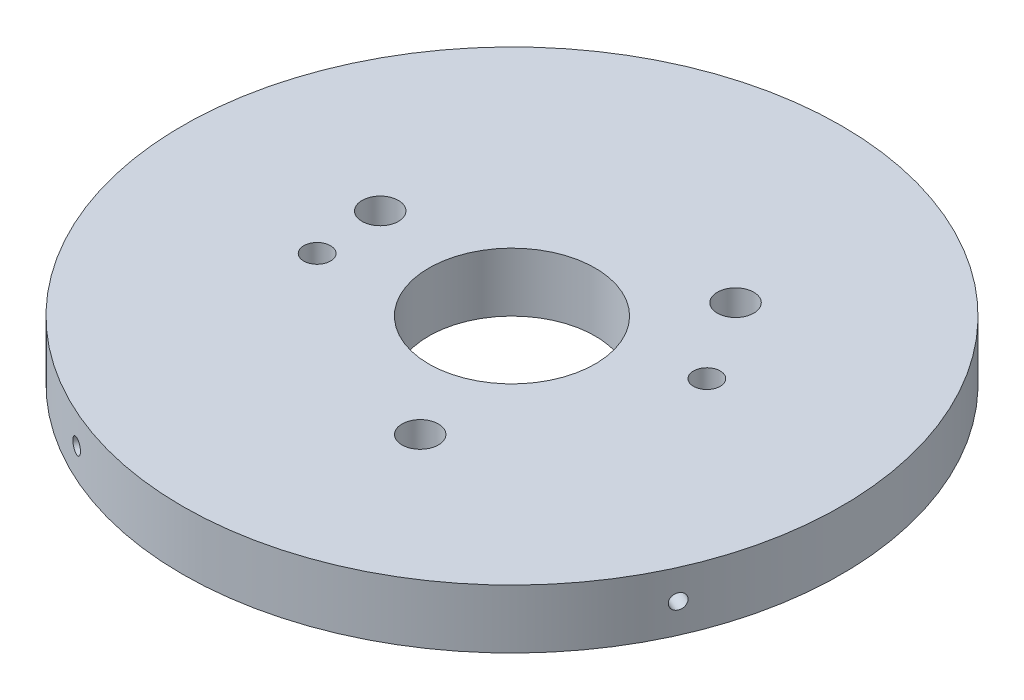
ISO-10303-21;
HEADER;
FILE_DESCRIPTION(('STEP AP214'),'2;1');
FILE_NAME('part.step','',(''),(''),'','','');
FILE_SCHEMA(('AUTOMOTIVE_DESIGN { 1 0 10303 214 1 1 1 1 }'));
ENDSEC;
DATA;
#1=APPLICATION_CONTEXT('core data for automotive mechanical design processes');
#2=APPLICATION_PROTOCOL_DEFINITION('international standard','automotive_design',2000,#1);
#3=PRODUCT_CONTEXT('',#1,'mechanical');
#4=PRODUCT('Part','Part','',(#3));
#5=PRODUCT_RELATED_PRODUCT_CATEGORY('part','',(#4));
#6=PRODUCT_DEFINITION_FORMATION('','',#4);
#7=PRODUCT_DEFINITION_CONTEXT('part definition',#1,'design');
#8=PRODUCT_DEFINITION('design','',#6,#7);
#9=PRODUCT_DEFINITION_SHAPE('','',#8);
#10=(LENGTH_UNIT() NAMED_UNIT(*) SI_UNIT(.MILLI.,.METRE.));
#11=(NAMED_UNIT(*) PLANE_ANGLE_UNIT() SI_UNIT($,.RADIAN.));
#12=(NAMED_UNIT(*) SI_UNIT($,.STERADIAN.) SOLID_ANGLE_UNIT());
#13=UNCERTAINTY_MEASURE_WITH_UNIT(LENGTH_MEASURE(1.E-05),#10,'distance_accuracy_value','');
#14=(GEOMETRIC_REPRESENTATION_CONTEXT(3) GLOBAL_UNCERTAINTY_ASSIGNED_CONTEXT((#13)) GLOBAL_UNIT_ASSIGNED_CONTEXT((#10,
#11,#12)) REPRESENTATION_CONTEXT('',''));
#15=CARTESIAN_POINT('',(0.,0.,0.));
#16=DIRECTION('',(0.,0.,1.));
#17=DIRECTION('',(1.,0.,0.));
#18=AXIS2_PLACEMENT_3D('',#15,#16,#17);
#19=CARTESIAN_POINT('',(0.,0.,0.));
#20=DIRECTION('',(0.,1.,0.));
#21=DIRECTION('',(0.,0.,1.));
#22=AXIS2_PLACEMENT_3D('',#19,#20,#21);
#23=PLANE('',#22);
#24=CARTESIAN_POINT('',(22.90521231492,0.,-6.52195682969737));
#25=DIRECTION('',(0.,-1.,0.));
#26=DIRECTION('',(0.,0.,-1.));
#27=AXIS2_PLACEMENT_3D('',#24,#25,#26);
#28=CIRCLE('',#27,2.01929999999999);
#29=CARTESIAN_POINT('',(22.90521231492,0.,-8.54125682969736));
#30=VERTEX_POINT('',#29);
#31=EDGE_CURVE('E77',#30,#30,#28,.T.);
#32=ORIENTED_EDGE('',*,*,#31,.F.);
#33=EDGE_LOOP('',(#32));
#34=FACE_BOUND('',#33,.T.);
#35=CARTESIAN_POINT('',(15.1382985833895,0.,-18.6234238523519));
#36=DIRECTION('',(0.,-1.,0.));
#37=DIRECTION('',(0.,0.,-1.));
#38=AXIS2_PLACEMENT_3D('',#35,#36,#37);
#39=CIRCLE('',#38,6.12);
#40=CARTESIAN_POINT('',(15.1382985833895,0.,-24.7434238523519));
#41=VERTEX_POINT('',#40);
#42=EDGE_CURVE('E86',#41,#41,#39,.T.);
#43=ORIENTED_EDGE('',*,*,#42,.F.);
#44=EDGE_LOOP('',(#43));
#45=FACE_BOUND('',#44,.T.);
#46=CARTESIAN_POINT('',(8.55920886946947,0.,22.4218630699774));
#47=DIRECTION('',(0.,-1.,0.));
#48=DIRECTION('',(0.,0.,-1.));
#49=AXIS2_PLACEMENT_3D('',#46,#47,#48);
#50=CIRCLE('',#49,6.12);
#51=CARTESIAN_POINT('',(8.55920886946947,0.,16.3018630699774));
#52=VERTEX_POINT('',#51);
#53=EDGE_CURVE('E98',#52,#52,#50,.T.);
#54=ORIENTED_EDGE('',*,*,#53,.F.);
#55=EDGE_LOOP('',(#54));
#56=FACE_BOUND('',#55,.T.);
#57=CARTESIAN_POINT('',(-23.6975074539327,0.,-3.79843921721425));
#58=DIRECTION('',(0.,-1.,0.));
#59=DIRECTION('',(0.,0.,-1.));
#60=AXIS2_PLACEMENT_3D('',#57,#58,#59);
#61=CIRCLE('',#60,6.12);
#62=CARTESIAN_POINT('',(-23.6975074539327,0.,-9.91843921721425));
#63=VERTEX_POINT('',#62);
#64=EDGE_CURVE('E110',#63,#63,#61,.T.);
#65=ORIENTED_EDGE('',*,*,#64,.F.);
#66=EDGE_LOOP('',(#65));
#67=FACE_BOUND('',#66,.T.);
#68=CARTESIAN_POINT('',(0.,0.,0.));
#69=DIRECTION('',(0.,1.,0.));
#70=DIRECTION('',(0.,0.,1.));
#71=AXIS2_PLACEMENT_3D('',#68,#69,#70);
#72=CIRCLE('',#71,49.7713);
#73=CARTESIAN_POINT('',(0.,0.,49.7713));
#74=VERTEX_POINT('',#73);
#75=EDGE_CURVE('E126',#74,#74,#72,.T.);
#76=ORIENTED_EDGE('',*,*,#75,.F.);
#77=EDGE_LOOP('',(#76));
#78=FACE_BOUND('',#77,.T.);
#79=CARTESIAN_POINT('',(0.,0.,0.));
#80=DIRECTION('',(0.,1.,0.));
#81=DIRECTION('',(0.,0.,1.));
#82=AXIS2_PLACEMENT_3D('',#79,#80,#81);
#83=CIRCLE('',#82,12.5603);
#84=CARTESIAN_POINT('',(0.,0.,12.5603));
#85=VERTEX_POINT('',#84);
#86=EDGE_CURVE('E122',#85,#85,#83,.T.);
#87=ORIENTED_EDGE('',*,*,#86,.T.);
#88=EDGE_LOOP('',(#87));
#89=FACE_BOUND('',#88,.T.);
#90=CARTESIAN_POINT('',(-22.90521231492,0.,6.52195682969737));
#91=DIRECTION('',(0.,-1.,0.));
#92=DIRECTION('',(0.,0.,-1.));
#93=AXIS2_PLACEMENT_3D('',#90,#91,#92);
#94=CIRCLE('',#93,2.01929999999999);
#95=CARTESIAN_POINT('',(-22.90521231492,0.,4.50265682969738));
#96=VERTEX_POINT('',#95);
#97=EDGE_CURVE('E217',#96,#96,#94,.T.);
#98=ORIENTED_EDGE('',*,*,#97,.F.);
#99=EDGE_LOOP('',(#98));
#100=FACE_BOUND('',#99,.T.);
#101=ADVANCED_FACE('F35',(#34,#45,#56,#67,#78,#89,#100),#23,.F.);
#102=CARTESIAN_POINT('',(0.,8.89,0.));
#103=DIRECTION('',(0.,1.,0.));
#104=DIRECTION('',(0.,0.,1.));
#105=AXIS2_PLACEMENT_3D('',#102,#103,#104);
#106=PLANE('',#105);
#107=CARTESIAN_POINT('',(-22.90521231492,8.89,6.52195682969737));
#108=DIRECTION('',(0.,-1.,0.));
#109=DIRECTION('',(0.,0.,-1.));
#110=AXIS2_PLACEMENT_3D('',#107,#108,#109);
#111=CIRCLE('',#110,2.0193);
#112=CARTESIAN_POINT('',(-22.90521231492,8.89,4.50265682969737));
#113=VERTEX_POINT('',#112);
#114=EDGE_CURVE('E219',#113,#113,#111,.T.);
#115=ORIENTED_EDGE('',*,*,#114,.T.);
#116=EDGE_LOOP('',(#115));
#117=FACE_BOUND('',#116,.T.);
#118=CARTESIAN_POINT('',(22.90521231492,8.89,-6.52195682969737));
#119=DIRECTION('',(0.,-1.,0.));
#120=DIRECTION('',(0.,0.,-1.));
#121=AXIS2_PLACEMENT_3D('',#118,#119,#120);
#122=CIRCLE('',#121,2.0193);
#123=CARTESIAN_POINT('',(22.90521231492,8.89,-8.54125682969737));
#124=VERTEX_POINT('',#123);
#125=EDGE_CURVE('E71',#124,#124,#122,.T.);
#126=ORIENTED_EDGE('',*,*,#125,.T.);
#127=EDGE_LOOP('',(#126));
#128=FACE_BOUND('',#127,.T.);
#129=CARTESIAN_POINT('',(15.1382985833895,8.89,-18.6234238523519));
#130=DIRECTION('',(0.,-1.,0.));
#131=DIRECTION('',(0.,0.,-1.));
#132=AXIS2_PLACEMENT_3D('',#129,#130,#131);
#133=CIRCLE('',#132,2.75);
#134=CARTESIAN_POINT('',(15.1382985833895,8.89,-21.3734238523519));
#135=VERTEX_POINT('',#134);
#136=EDGE_CURVE('E95',#135,#135,#133,.T.);
#137=ORIENTED_EDGE('',*,*,#136,.T.);
#138=EDGE_LOOP('',(#137));
#139=FACE_BOUND('',#138,.T.);
#140=CARTESIAN_POINT('',(8.55920886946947,8.89,22.4218630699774));
#141=DIRECTION('',(0.,-1.,0.));
#142=DIRECTION('',(0.,0.,-1.));
#143=AXIS2_PLACEMENT_3D('',#140,#141,#142);
#144=CIRCLE('',#143,2.75);
#145=CARTESIAN_POINT('',(8.55920886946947,8.89,19.6718630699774));
#146=VERTEX_POINT('',#145);
#147=EDGE_CURVE('E107',#146,#146,#144,.T.);
#148=ORIENTED_EDGE('',*,*,#147,.T.);
#149=EDGE_LOOP('',(#148));
#150=FACE_BOUND('',#149,.T.);
#151=CARTESIAN_POINT('',(-23.6975074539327,8.89,-3.79843921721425));
#152=DIRECTION('',(0.,-1.,0.));
#153=DIRECTION('',(0.,0.,-1.));
#154=AXIS2_PLACEMENT_3D('',#151,#152,#153);
#155=CIRCLE('',#154,2.75);
#156=CARTESIAN_POINT('',(-23.6975074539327,8.89,-6.54843921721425));
#157=VERTEX_POINT('',#156);
#158=EDGE_CURVE('E119',#157,#157,#155,.T.);
#159=ORIENTED_EDGE('',*,*,#158,.T.);
#160=EDGE_LOOP('',(#159));
#161=FACE_BOUND('',#160,.T.);
#162=CARTESIAN_POINT('',(0.,8.89,0.));
#163=DIRECTION('',(0.,1.,0.));
#164=DIRECTION('',(0.,0.,1.));
#165=AXIS2_PLACEMENT_3D('',#162,#163,#164);
#166=CIRCLE('',#165,49.7713);
#167=CARTESIAN_POINT('',(0.,8.89,49.7713));
#168=VERTEX_POINT('',#167);
#169=EDGE_CURVE('E129',#168,#168,#166,.T.);
#170=ORIENTED_EDGE('',*,*,#169,.T.);
#171=EDGE_LOOP('',(#170));
#172=FACE_BOUND('',#171,.T.);
#173=CARTESIAN_POINT('',(0.,8.89,0.));
#174=DIRECTION('',(0.,1.,0.));
#175=DIRECTION('',(0.,0.,1.));
#176=AXIS2_PLACEMENT_3D('',#173,#174,#175);
#177=CIRCLE('',#176,12.5603);
#178=CARTESIAN_POINT('',(0.,8.89,12.5603));
#179=VERTEX_POINT('',#178);
#180=EDGE_CURVE('E123',#179,#179,#177,.T.);
#181=ORIENTED_EDGE('',*,*,#180,.F.);
#182=EDGE_LOOP('',(#181));
#183=FACE_BOUND('',#182,.T.);
#184=ADVANCED_FACE('F195',(#117,#128,#139,#150,#161,#172,#183),#106,.T.);
#185=CARTESIAN_POINT('',(0.,8.89,0.));
#186=DIRECTION('',(0.,-1.,0.));
#187=DIRECTION('',(0.,0.,-1.));
#188=AXIS2_PLACEMENT_3D('',#185,#186,#187);
#189=CYLINDRICAL_SURFACE('',#188,49.7713);
#190=CARTESIAN_POINT('',(45.8793955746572,4.445,19.2941277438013));
#191=CARTESIAN_POINT('',(45.8793945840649,4.38151933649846,19.2941303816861));
#192=CARTESIAN_POINT('',(45.8773157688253,4.31799285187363,19.2990756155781));
#193=CARTESIAN_POINT('',(45.8690427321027,4.19269003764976,19.3187300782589));
#194=CARTESIAN_POINT('',(45.862843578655,4.13091589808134,19.3334510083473));
#195=CARTESIAN_POINT('',(45.8464791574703,4.01095119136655,19.3722247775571));
#196=CARTESIAN_POINT('',(45.8363158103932,3.95275890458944,19.3962730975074));
#197=CARTESIAN_POINT('',(45.812272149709,3.84159852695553,19.4529938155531));
#198=CARTESIAN_POINT('',(45.7983927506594,3.78862915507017,19.4856640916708));
#199=CARTESIAN_POINT('',(45.7672534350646,3.68938469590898,19.5586908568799));
#200=CARTESIAN_POINT('',(45.7499926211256,3.64311139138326,19.5990493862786));
#201=CARTESIAN_POINT('',(45.7125254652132,3.55858743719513,19.6862786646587));
#202=CARTESIAN_POINT('',(45.6923190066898,3.52033710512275,19.7331496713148));
#203=CARTESIAN_POINT('',(45.6494782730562,3.45294378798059,19.8320532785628));
#204=CARTESIAN_POINT('',(45.6268437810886,3.42380161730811,19.8840863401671));
#205=CARTESIAN_POINT('',(45.5797451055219,3.375457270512,19.9918131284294));
#206=CARTESIAN_POINT('',(45.5552809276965,3.35625506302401,20.0475068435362));
#207=CARTESIAN_POINT('',(45.5051894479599,3.32833885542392,20.1609493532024));
#208=CARTESIAN_POINT('',(45.4795623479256,3.31962304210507,20.2186977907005));
#209=CARTESIAN_POINT('',(45.4278535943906,3.31292145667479,20.3346120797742));
#210=CARTESIAN_POINT('',(45.4017719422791,3.31493565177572,20.3927779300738));
#211=CARTESIAN_POINT('',(45.3499030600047,3.32963534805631,20.5078663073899));
#212=CARTESIAN_POINT('',(45.3241157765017,3.34231888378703,20.5647890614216));
#213=CARTESIAN_POINT('',(45.2735845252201,3.37799418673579,20.6757967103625));
#214=CARTESIAN_POINT('',(45.2488405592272,3.40098597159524,20.7298816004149));
#215=CARTESIAN_POINT('',(45.2011335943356,3.45662736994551,20.8337009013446));
#216=CARTESIAN_POINT('',(45.1781707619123,3.48927788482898,20.8834349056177));
#217=CARTESIAN_POINT('',(45.1347294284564,3.56330922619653,20.9771584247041));
#218=CARTESIAN_POINT('',(45.1142509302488,3.60469006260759,21.0211479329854));
#219=CARTESIAN_POINT('',(45.0764103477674,3.69501852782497,21.1021690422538));
#220=CARTESIAN_POINT('',(45.059048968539,3.74396786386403,21.1391990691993));
#221=CARTESIAN_POINT('',(45.0279964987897,3.84803779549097,21.2052628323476));
#222=CARTESIAN_POINT('',(45.0143054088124,3.90315839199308,21.2342965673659));
#223=CARTESIAN_POINT('',(44.9910312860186,4.01800710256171,21.2835653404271));
#224=CARTESIAN_POINT('',(44.9814482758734,4.07773524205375,21.3038003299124));
#225=CARTESIAN_POINT('',(44.966699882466,4.20010312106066,21.3349128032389));
#226=CARTESIAN_POINT('',(44.9615344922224,4.26274285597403,21.3457903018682));
#227=CARTESIAN_POINT('',(44.955789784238,4.38914079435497,21.357886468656));
#228=CARTESIAN_POINT('',(44.9552094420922,4.45289874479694,21.3591072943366));
#229=CARTESIAN_POINT('',(44.9586510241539,4.57973640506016,21.3518621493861));
#230=CARTESIAN_POINT('',(44.9626729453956,4.64281611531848,21.3433961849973));
#231=CARTESIAN_POINT('',(44.9751876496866,4.76650001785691,21.3170122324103));
#232=CARTESIAN_POINT('',(44.9836799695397,4.82710446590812,21.299095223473));
#233=CARTESIAN_POINT('',(45.0048606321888,4.94412532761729,21.2543038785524));
#234=CARTESIAN_POINT('',(45.0175489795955,5.00054173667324,21.2274295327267));
#235=CARTESIAN_POINT('',(45.0467176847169,5.10759604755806,21.165460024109));
#236=CARTESIAN_POINT('',(45.0631987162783,5.15823292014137,21.1303634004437));
#237=CARTESIAN_POINT('',(45.0994295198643,5.25228041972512,21.052923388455));
#238=CARTESIAN_POINT('',(45.1191792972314,5.29569103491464,21.0105799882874));
#239=CARTESIAN_POINT('',(45.1613350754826,5.37406168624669,20.9198139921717));
#240=CARTESIAN_POINT('',(45.183741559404,5.40902018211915,20.8713902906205));
#241=CARTESIAN_POINT('',(45.2305203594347,5.46948369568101,20.7698207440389));
#242=CARTESIAN_POINT('',(45.2548926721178,5.49498872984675,20.7166749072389));
#243=CARTESIAN_POINT('',(45.3048675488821,5.53581863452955,20.6071565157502));
#244=CARTESIAN_POINT('',(45.3304699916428,5.55114450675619,20.5507842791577));
#245=CARTESIAN_POINT('',(45.3821541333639,5.57118433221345,20.436397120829));
#246=CARTESIAN_POINT('',(45.4082358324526,5.5758982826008,20.3783821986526));
#247=CARTESIAN_POINT('',(45.4601234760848,5.57458031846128,20.2623669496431));
#248=CARTESIAN_POINT('',(45.4859294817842,5.56855083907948,20.204366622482));
#249=CARTESIAN_POINT('',(45.5365498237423,5.54592216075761,20.0900185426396));
#250=CARTESIAN_POINT('',(45.5613641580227,5.52932294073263,20.0336707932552));
#251=CARTESIAN_POINT('',(45.60932562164,5.48602613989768,19.9242388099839));
#252=CARTESIAN_POINT('',(45.6324727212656,5.45932837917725,19.8711546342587));
#253=CARTESIAN_POINT('',(45.6764846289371,5.39659367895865,19.7697777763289));
#254=CARTESIAN_POINT('',(45.6973495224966,5.36055708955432,19.7214849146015));
#255=CARTESIAN_POINT('',(45.7362612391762,5.28016238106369,19.631075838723));
#256=CARTESIAN_POINT('',(45.7543077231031,5.23580326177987,19.588960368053));
#257=CARTESIAN_POINT('',(45.7871282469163,5.14001039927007,19.5121229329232));
#258=CARTESIAN_POINT('',(45.8019014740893,5.08857490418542,19.4774028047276));
#259=CARTESIAN_POINT('',(45.827811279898,4.98007401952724,19.4163621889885));
#260=CARTESIAN_POINT('',(45.8389457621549,4.92300540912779,19.390046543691));
#261=CARTESIAN_POINT('',(45.8572852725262,4.80492493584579,19.3466341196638));
#262=CARTESIAN_POINT('',(45.8644949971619,4.74391788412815,19.3295263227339));
#263=CARTESIAN_POINT('',(45.8728972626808,4.64293665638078,19.3095744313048));
#264=CARTESIAN_POINT('',(45.8753314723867,4.60361823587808,19.3037893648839));
#265=CARTESIAN_POINT('',(45.8785809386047,4.52453920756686,19.296065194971));
#266=CARTESIAN_POINT('',(45.8793961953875,4.4847785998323,19.2941260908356));
#267=CARTESIAN_POINT('',(45.8793955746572,4.445,19.2941277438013));
#268=B_SPLINE_CURVE_WITH_KNOTS('',3,(#190,#191,#192,#193,#194,#195,#196,#197,#198,#199,#200,
#201,#202,#203,#204,#205,#206,#207,#208,#209,#210,#211,#212,#213,#214,#215,#216,#217,#218,#219,
#220,#221,#222,#223,#224,#225,#226,#227,#228,#229,#230,#231,#232,#233,#234,#235,#236,#237,#238,
#239,#240,#241,#242,#243,#244,#245,#246,#247,#248,#249,#250,#251,#252,#253,#254,#255,#256,#257,
#258,#259,#260,#261,#262,#263,#264,#265,#266,#267),.UNSPECIFIED.,.T.,.F.,(4,2,2,2,2,2,2,2,2,2,2,
2,2,2,2,2,2,2,2,2,2,2,2,2,2,2,2,2,2,2,2,2,2,2,2,2,2,2,4),(0.,0.190296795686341,
0.380821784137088,0.571254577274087,0.761640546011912,0.952077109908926,1.14252121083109,
1.33298233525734,1.52344285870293,1.7138704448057,1.90429744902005,2.09468938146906,
2.28508163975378,2.47549167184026,2.66590192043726,2.85635518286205,3.04680847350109,
3.23726281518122,3.42771685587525,3.61812834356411,3.80853970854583,3.9989313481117,
4.18932319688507,4.37974889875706,4.57017491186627,4.76063560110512,4.95109595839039,
5.14153757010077,5.33197923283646,5.52237773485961,5.71277661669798,5.90317889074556,
6.09357402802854,6.28399206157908,6.47445732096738,6.66503211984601,6.85537836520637,
6.97462320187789,7.09386801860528),.UNSPECIFIED.);
#269=CARTESIAN_POINT('',(45.8793955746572,4.445,19.2941277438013));
#270=VERTEX_POINT('',#269);
#271=EDGE_CURVE('E11',#270,#270,#268,.T.);
#272=ORIENTED_EDGE('',*,*,#271,.T.);
#273=EDGE_LOOP('',(#272));
#274=FACE_BOUND('',#273,.T.);
#275=CARTESIAN_POINT('',(19.2941277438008,4.445,-45.8793955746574));
#276=CARTESIAN_POINT('',(19.2941303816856,4.38151933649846,-45.8793945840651));
#277=CARTESIAN_POINT('',(19.2990756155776,4.31799285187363,-45.8773157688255));
#278=CARTESIAN_POINT('',(19.3187300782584,4.19269003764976,-45.8690427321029));
#279=CARTESIAN_POINT('',(19.3334510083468,4.13091589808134,-45.8628435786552));
#280=CARTESIAN_POINT('',(19.3722247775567,4.01095119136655,-45.8464791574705));
#281=CARTESIAN_POINT('',(19.3962730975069,3.95275890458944,-45.8363158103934));
#282=CARTESIAN_POINT('',(19.4529938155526,3.84159852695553,-45.8122721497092));
#283=CARTESIAN_POINT('',(19.4856640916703,3.78862915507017,-45.7983927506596));
#284=CARTESIAN_POINT('',(19.5586908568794,3.68938469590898,-45.7672534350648));
#285=CARTESIAN_POINT('',(19.5990493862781,3.64311139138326,-45.7499926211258));
#286=CARTESIAN_POINT('',(19.6862786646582,3.55858743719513,-45.7125254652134));
#287=CARTESIAN_POINT('',(19.7331496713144,3.52033710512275,-45.69231900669));
#288=CARTESIAN_POINT('',(19.8320532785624,3.45294378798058,-45.6494782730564));
#289=CARTESIAN_POINT('',(19.8840863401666,3.42380161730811,-45.6268437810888));
#290=CARTESIAN_POINT('',(19.9918131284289,3.375457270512,-45.5797451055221));
#291=CARTESIAN_POINT('',(20.0475068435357,3.35625506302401,-45.5552809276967));
#292=CARTESIAN_POINT('',(20.1609493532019,3.32833885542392,-45.5051894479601));
#293=CARTESIAN_POINT('',(20.2186977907,3.31962304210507,-45.4795623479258));
#294=CARTESIAN_POINT('',(20.3346120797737,3.31292145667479,-45.4278535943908));
#295=CARTESIAN_POINT('',(20.3927779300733,3.31493565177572,-45.4017719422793));
#296=CARTESIAN_POINT('',(20.5078663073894,3.32963534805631,-45.349903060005));
#297=CARTESIAN_POINT('',(20.5647890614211,3.34231888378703,-45.3241157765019));
#298=CARTESIAN_POINT('',(20.6757967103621,3.37799418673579,-45.2735845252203));
#299=CARTESIAN_POINT('',(20.7298816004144,3.40098597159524,-45.2488405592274));
#300=CARTESIAN_POINT('',(20.8337009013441,3.45662736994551,-45.2011335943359));
#301=CARTESIAN_POINT('',(20.8834349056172,3.48927788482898,-45.1781707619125));
#302=CARTESIAN_POINT('',(20.9771584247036,3.56330922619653,-45.1347294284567));
#303=CARTESIAN_POINT('',(21.0211479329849,3.60469006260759,-45.114250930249));
#304=CARTESIAN_POINT('',(21.1021690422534,3.69501852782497,-45.0764103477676));
#305=CARTESIAN_POINT('',(21.1391990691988,3.74396786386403,-45.0590489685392));
#306=CARTESIAN_POINT('',(21.2052628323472,3.84803779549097,-45.0279964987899));
#307=CARTESIAN_POINT('',(21.2342965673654,3.90315839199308,-45.0143054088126));
#308=CARTESIAN_POINT('',(21.2835653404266,4.01800710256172,-44.9910312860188));
#309=CARTESIAN_POINT('',(21.3038003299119,4.07773524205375,-44.9814482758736));
#310=CARTESIAN_POINT('',(21.3349128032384,4.20010312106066,-44.9666998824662));
#311=CARTESIAN_POINT('',(21.3457903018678,4.26274285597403,-44.9615344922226));
#312=CARTESIAN_POINT('',(21.3578864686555,4.38914079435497,-44.9557897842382));
#313=CARTESIAN_POINT('',(21.3591072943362,4.45289874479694,-44.9552094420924));
#314=CARTESIAN_POINT('',(21.3518621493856,4.57973640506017,-44.9586510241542));
#315=CARTESIAN_POINT('',(21.3433961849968,4.64281611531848,-44.9626729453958));
#316=CARTESIAN_POINT('',(21.3170122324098,4.76650001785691,-44.9751876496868));
#317=CARTESIAN_POINT('',(21.2990952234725,4.82710446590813,-44.9836799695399));
#318=CARTESIAN_POINT('',(21.254303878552,4.94412532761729,-45.0048606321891));
#319=CARTESIAN_POINT('',(21.2274295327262,5.00054173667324,-45.0175489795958));
#320=CARTESIAN_POINT('',(21.1654600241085,5.10759604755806,-45.0467176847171));
#321=CARTESIAN_POINT('',(21.1303634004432,5.15823292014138,-45.0631987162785));
#322=CARTESIAN_POINT('',(21.0529233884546,5.25228041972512,-45.0994295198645));
#323=CARTESIAN_POINT('',(21.0105799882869,5.29569103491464,-45.1191792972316));
#324=CARTESIAN_POINT('',(20.9198139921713,5.37406168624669,-45.1613350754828));
#325=CARTESIAN_POINT('',(20.87139029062,5.40902018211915,-45.1837415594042));
#326=CARTESIAN_POINT('',(20.7698207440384,5.46948369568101,-45.2305203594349));
#327=CARTESIAN_POINT('',(20.7166749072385,5.49498872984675,-45.254892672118));
#328=CARTESIAN_POINT('',(20.6071565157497,5.53581863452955,-45.3048675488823));
#329=CARTESIAN_POINT('',(20.5507842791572,5.55114450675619,-45.330469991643));
#330=CARTESIAN_POINT('',(20.4363971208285,5.57118433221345,-45.3821541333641));
#331=CARTESIAN_POINT('',(20.3783821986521,5.5758982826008,-45.4082358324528));
#332=CARTESIAN_POINT('',(20.2623669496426,5.57458031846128,-45.460123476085));
#333=CARTESIAN_POINT('',(20.2043666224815,5.56855083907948,-45.4859294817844));
#334=CARTESIAN_POINT('',(20.0900185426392,5.54592216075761,-45.5365498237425));
#335=CARTESIAN_POINT('',(20.0336707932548,5.52932294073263,-45.5613641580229));
#336=CARTESIAN_POINT('',(19.9242388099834,5.48602613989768,-45.6093256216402));
#337=CARTESIAN_POINT('',(19.8711546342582,5.45932837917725,-45.6324727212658));
#338=CARTESIAN_POINT('',(19.7697777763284,5.39659367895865,-45.6764846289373));
#339=CARTESIAN_POINT('',(19.721484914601,5.36055708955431,-45.6973495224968));
#340=CARTESIAN_POINT('',(19.6310758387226,5.28016238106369,-45.7362612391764));
#341=CARTESIAN_POINT('',(19.5889603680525,5.23580326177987,-45.7543077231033));
#342=CARTESIAN_POINT('',(19.5121229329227,5.14001039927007,-45.7871282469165));
#343=CARTESIAN_POINT('',(19.4774028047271,5.08857490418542,-45.8019014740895));
#344=CARTESIAN_POINT('',(19.416362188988,4.98007401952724,-45.8278112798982));
#345=CARTESIAN_POINT('',(19.3900465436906,4.92300540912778,-45.8389457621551));
#346=CARTESIAN_POINT('',(19.3466341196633,4.80492493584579,-45.8572852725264));
#347=CARTESIAN_POINT('',(19.3295263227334,4.74391788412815,-45.8644949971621));
#348=CARTESIAN_POINT('',(19.3095744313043,4.64293665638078,-45.872897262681));
#349=CARTESIAN_POINT('',(19.3037893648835,4.60361823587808,-45.8753314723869));
#350=CARTESIAN_POINT('',(19.2960651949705,4.52453920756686,-45.8785809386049));
#351=CARTESIAN_POINT('',(19.2941260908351,4.4847785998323,-45.8793961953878));
#352=CARTESIAN_POINT('',(19.2941277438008,4.445,-45.8793955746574));
#353=B_SPLINE_CURVE_WITH_KNOTS('',3,(#275,#276,#277,#278,#279,#280,#281,#282,#283,#284,#285,
#286,#287,#288,#289,#290,#291,#292,#293,#294,#295,#296,#297,#298,#299,#300,#301,#302,#303,#304,
#305,#306,#307,#308,#309,#310,#311,#312,#313,#314,#315,#316,#317,#318,#319,#320,#321,#322,#323,
#324,#325,#326,#327,#328,#329,#330,#331,#332,#333,#334,#335,#336,#337,#338,#339,#340,#341,#342,
#343,#344,#345,#346,#347,#348,#349,#350,#351,#352),.UNSPECIFIED.,.T.,.F.,(4,2,2,2,2,2,2,2,2,2,2,
2,2,2,2,2,2,2,2,2,2,2,2,2,2,2,2,2,2,2,2,2,2,2,2,2,2,2,4),(0.,0.190296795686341,0.38082178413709,
0.571254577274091,0.761640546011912,0.95207710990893,1.1425212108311,1.33298233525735,
1.52344285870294,1.7138704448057,1.90429744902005,2.09468938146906,2.28508163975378,
2.47549167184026,2.66590192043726,2.85635518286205,3.04680847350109,3.23726281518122,
3.42771685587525,3.61812834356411,3.80853970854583,3.9989313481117,4.18932319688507,
4.37974889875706,4.57017491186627,4.76063560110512,4.95109595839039,5.14153757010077,
5.33197923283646,5.5223777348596,5.71277661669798,5.90317889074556,6.09357402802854,
6.28399206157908,6.47445732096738,6.66503211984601,6.85537836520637,6.97462320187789,
7.09386801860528),.UNSPECIFIED.);
#354=CARTESIAN_POINT('',(19.2941277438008,4.445,-45.8793955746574));
#355=VERTEX_POINT('',#354);
#356=EDGE_CURVE('E47',#355,#355,#353,.T.);
#357=ORIENTED_EDGE('',*,*,#356,.T.);
#358=EDGE_LOOP('',(#357));
#359=FACE_BOUND('',#358,.T.);
#360=CARTESIAN_POINT('',(-45.8793955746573,4.445,-19.294127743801));
#361=CARTESIAN_POINT('',(-45.8793945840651,4.38151933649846,-19.2941303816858));
#362=CARTESIAN_POINT('',(-45.8773157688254,4.31799285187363,-19.2990756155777));
#363=CARTESIAN_POINT('',(-45.8690427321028,4.19269003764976,-19.3187300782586));
#364=CARTESIAN_POINT('',(-45.8628435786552,4.13091589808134,-19.333451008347));
#365=CARTESIAN_POINT('',(-45.8464791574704,4.01095119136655,-19.3722247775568));
#366=CARTESIAN_POINT('',(-45.8363158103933,3.95275890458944,-19.3962730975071));
#367=CARTESIAN_POINT('',(-45.8122721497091,3.84159852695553,-19.4529938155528));
#368=CARTESIAN_POINT('',(-45.7983927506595,3.78862915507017,-19.4856640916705));
#369=CARTESIAN_POINT('',(-45.7672534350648,3.68938469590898,-19.5586908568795));
#370=CARTESIAN_POINT('',(-45.7499926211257,3.64311139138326,-19.5990493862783));
#371=CARTESIAN_POINT('',(-45.7125254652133,3.55858743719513,-19.6862786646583));
#372=CARTESIAN_POINT('',(-45.69231900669,3.52033710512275,-19.7331496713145));
#373=CARTESIAN_POINT('',(-45.6494782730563,3.45294378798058,-19.8320532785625));
#374=CARTESIAN_POINT('',(-45.6268437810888,3.42380161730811,-19.8840863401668));
#375=CARTESIAN_POINT('',(-45.5797451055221,3.375457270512,-19.9918131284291));
#376=CARTESIAN_POINT('',(-45.5552809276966,3.35625506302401,-20.0475068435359));
#377=CARTESIAN_POINT('',(-45.5051894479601,3.32833885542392,-20.160949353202));
#378=CARTESIAN_POINT('',(-45.4795623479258,3.31962304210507,-20.2186977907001));
#379=CARTESIAN_POINT('',(-45.4278535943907,3.31292145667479,-20.3346120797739));
#380=CARTESIAN_POINT('',(-45.4017719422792,3.31493565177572,-20.3927779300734));
#381=CARTESIAN_POINT('',(-45.3499030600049,3.32963534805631,-20.5078663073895));
#382=CARTESIAN_POINT('',(-45.3241157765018,3.34231888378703,-20.5647890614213));
#383=CARTESIAN_POINT('',(-45.2735845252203,3.37799418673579,-20.6757967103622));
#384=CARTESIAN_POINT('',(-45.2488405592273,3.40098597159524,-20.7298816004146));
#385=CARTESIAN_POINT('',(-45.2011335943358,3.45662736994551,-20.8337009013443));
#386=CARTESIAN_POINT('',(-45.1781707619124,3.48927788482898,-20.8834349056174));
#387=CARTESIAN_POINT('',(-45.1347294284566,3.56330922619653,-20.9771584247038));
#388=CARTESIAN_POINT('',(-45.1142509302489,3.60469006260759,-21.0211479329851));
#389=CARTESIAN_POINT('',(-45.0764103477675,3.69501852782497,-21.1021690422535));
#390=CARTESIAN_POINT('',(-45.0590489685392,3.74396786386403,-21.139199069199));
#391=CARTESIAN_POINT('',(-45.0279964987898,3.84803779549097,-21.2052628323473));
#392=CARTESIAN_POINT('',(-45.0143054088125,3.90315839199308,-21.2342965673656));
#393=CARTESIAN_POINT('',(-44.9910312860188,4.01800710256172,-21.2835653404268));
#394=CARTESIAN_POINT('',(-44.9814482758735,4.07773524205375,-21.3038003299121));
#395=CARTESIAN_POINT('',(-44.9666998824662,4.20010312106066,-21.3349128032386));
#396=CARTESIAN_POINT('',(-44.9615344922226,4.26274285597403,-21.3457903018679));
#397=CARTESIAN_POINT('',(-44.9557897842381,4.38914079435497,-21.3578864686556));
#398=CARTESIAN_POINT('',(-44.9552094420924,4.45289874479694,-21.3591072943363));
#399=CARTESIAN_POINT('',(-44.9586510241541,4.57973640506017,-21.3518621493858));
#400=CARTESIAN_POINT('',(-44.9626729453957,4.64281611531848,-21.343396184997));
#401=CARTESIAN_POINT('',(-44.9751876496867,4.76650001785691,-21.31701223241));
#402=CARTESIAN_POINT('',(-44.9836799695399,4.82710446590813,-21.2990952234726));
#403=CARTESIAN_POINT('',(-45.004860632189,4.94412532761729,-21.2543038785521));
#404=CARTESIAN_POINT('',(-45.0175489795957,5.00054173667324,-21.2274295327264));
#405=CARTESIAN_POINT('',(-45.046717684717,5.10759604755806,-21.1654600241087));
#406=CARTESIAN_POINT('',(-45.0631987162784,5.15823292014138,-21.1303634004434));
#407=CARTESIAN_POINT('',(-45.0994295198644,5.25228041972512,-21.0529233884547));
#408=CARTESIAN_POINT('',(-45.1191792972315,5.29569103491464,-21.0105799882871));
#409=CARTESIAN_POINT('',(-45.1613350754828,5.37406168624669,-20.9198139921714));
#410=CARTESIAN_POINT('',(-45.1837415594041,5.40902018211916,-20.8713902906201));
#411=CARTESIAN_POINT('',(-45.2305203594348,5.46948369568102,-20.7698207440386));
#412=CARTESIAN_POINT('',(-45.254892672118,5.49498872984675,-20.7166749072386));
#413=CARTESIAN_POINT('',(-45.3048675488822,5.53581863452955,-20.6071565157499));
#414=CARTESIAN_POINT('',(-45.330469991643,5.55114450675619,-20.5507842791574));
#415=CARTESIAN_POINT('',(-45.382154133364,5.57118433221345,-20.4363971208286));
#416=CARTESIAN_POINT('',(-45.4082358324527,5.5758982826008,-20.3783821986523));
#417=CARTESIAN_POINT('',(-45.4601234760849,5.57458031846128,-20.2623669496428));
#418=CARTESIAN_POINT('',(-45.4859294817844,5.56855083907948,-20.2043666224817));
#419=CARTESIAN_POINT('',(-45.5365498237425,5.54592216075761,-20.0900185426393));
#420=CARTESIAN_POINT('',(-45.5613641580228,5.52932294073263,-20.0336707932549));
#421=CARTESIAN_POINT('',(-45.6093256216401,5.48602613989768,-19.9242388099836));
#422=CARTESIAN_POINT('',(-45.6324727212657,5.45932837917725,-19.8711546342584));
#423=CARTESIAN_POINT('',(-45.6764846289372,5.39659367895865,-19.7697777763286));
#424=CARTESIAN_POINT('',(-45.6973495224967,5.36055708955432,-19.7214849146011));
#425=CARTESIAN_POINT('',(-45.7362612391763,5.28016238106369,-19.6310758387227));
#426=CARTESIAN_POINT('',(-45.7543077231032,5.23580326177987,-19.5889603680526));
#427=CARTESIAN_POINT('',(-45.7871282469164,5.14001039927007,-19.5121229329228));
#428=CARTESIAN_POINT('',(-45.8019014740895,5.08857490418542,-19.4774028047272));
#429=CARTESIAN_POINT('',(-45.8278112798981,4.98007401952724,-19.4163621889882));
#430=CARTESIAN_POINT('',(-45.8389457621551,4.92300540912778,-19.3900465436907));
#431=CARTESIAN_POINT('',(-45.8572852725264,4.80492493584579,-19.3466341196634));
#432=CARTESIAN_POINT('',(-45.864494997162,4.74391788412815,-19.3295263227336));
#433=CARTESIAN_POINT('',(-45.8728972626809,4.64293665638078,-19.3095744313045));
#434=CARTESIAN_POINT('',(-45.8753314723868,4.60361823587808,-19.3037893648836));
#435=CARTESIAN_POINT('',(-45.8785809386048,4.52453920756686,-19.2960651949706));
#436=CARTESIAN_POINT('',(-45.8793961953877,4.4847785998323,-19.2941260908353));
#437=CARTESIAN_POINT('',(-45.8793955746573,4.445,-19.294127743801));
#438=B_SPLINE_CURVE_WITH_KNOTS('',3,(#360,#361,#362,#363,#364,#365,#366,#367,#368,#369,#370,
#371,#372,#373,#374,#375,#376,#377,#378,#379,#380,#381,#382,#383,#384,#385,#386,#387,#388,#389,
#390,#391,#392,#393,#394,#395,#396,#397,#398,#399,#400,#401,#402,#403,#404,#405,#406,#407,#408,
#409,#410,#411,#412,#413,#414,#415,#416,#417,#418,#419,#420,#421,#422,#423,#424,#425,#426,#427,
#428,#429,#430,#431,#432,#433,#434,#435,#436,#437),.UNSPECIFIED.,.T.,.F.,(4,2,2,2,2,2,2,2,2,2,2,
2,2,2,2,2,2,2,2,2,2,2,2,2,2,2,2,2,2,2,2,2,2,2,2,2,2,2,4),(0.,0.190296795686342,
0.380821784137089,0.571254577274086,0.761640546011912,0.952077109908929,1.1425212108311,
1.33298233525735,1.52344285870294,1.71387044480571,1.90429744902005,2.09468938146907,
2.28508163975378,2.47549167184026,2.66590192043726,2.85635518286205,3.04680847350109,
3.23726281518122,3.42771685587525,3.61812834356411,3.80853970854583,3.9989313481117,
4.18932319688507,4.37974889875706,4.57017491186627,4.76063560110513,4.95109595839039,
5.14153757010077,5.33197923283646,5.5223777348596,5.71277661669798,5.90317889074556,
6.09357402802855,6.28399206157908,6.47445732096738,6.66503211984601,6.85537836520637,
6.97462320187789,7.09386801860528),.UNSPECIFIED.);
#439=CARTESIAN_POINT('',(-45.8793955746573,4.445,-19.294127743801));
#440=VERTEX_POINT('',#439);
#441=EDGE_CURVE('E140',#440,#440,#438,.T.);
#442=ORIENTED_EDGE('',*,*,#441,.T.);
#443=EDGE_LOOP('',(#442));
#444=FACE_BOUND('',#443,.T.);
#445=CARTESIAN_POINT('',(-19.2941277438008,4.445,45.8793955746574));
#446=CARTESIAN_POINT('',(-19.2941303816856,4.38151933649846,45.8793945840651));
#447=CARTESIAN_POINT('',(-19.2990756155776,4.31799285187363,45.8773157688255));
#448=CARTESIAN_POINT('',(-19.3187300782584,4.19269003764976,45.8690427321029));
#449=CARTESIAN_POINT('',(-19.3334510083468,4.13091589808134,45.8628435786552));
#450=CARTESIAN_POINT('',(-19.3722247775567,4.01095119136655,45.8464791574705));
#451=CARTESIAN_POINT('',(-19.3962730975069,3.95275890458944,45.8363158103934));
#452=CARTESIAN_POINT('',(-19.4529938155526,3.84159852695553,45.8122721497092));
#453=CARTESIAN_POINT('',(-19.4856640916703,3.78862915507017,45.7983927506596));
#454=CARTESIAN_POINT('',(-19.5586908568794,3.68938469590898,45.7672534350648));
#455=CARTESIAN_POINT('',(-19.5990493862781,3.64311139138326,45.7499926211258));
#456=CARTESIAN_POINT('',(-19.6862786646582,3.55858743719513,45.7125254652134));
#457=CARTESIAN_POINT('',(-19.7331496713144,3.52033710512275,45.69231900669));
#458=CARTESIAN_POINT('',(-19.8320532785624,3.45294378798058,45.6494782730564));
#459=CARTESIAN_POINT('',(-19.8840863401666,3.42380161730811,45.6268437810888));
#460=CARTESIAN_POINT('',(-19.9918131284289,3.375457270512,45.5797451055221));
#461=CARTESIAN_POINT('',(-20.0475068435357,3.35625506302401,45.5552809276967));
#462=CARTESIAN_POINT('',(-20.1609493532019,3.32833885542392,45.5051894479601));
#463=CARTESIAN_POINT('',(-20.2186977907,3.31962304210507,45.4795623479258));
#464=CARTESIAN_POINT('',(-20.3346120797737,3.31292145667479,45.4278535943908));
#465=CARTESIAN_POINT('',(-20.3927779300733,3.31493565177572,45.4017719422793));
#466=CARTESIAN_POINT('',(-20.5078663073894,3.32963534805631,45.349903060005));
#467=CARTESIAN_POINT('',(-20.5647890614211,3.34231888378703,45.3241157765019));
#468=CARTESIAN_POINT('',(-20.6757967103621,3.37799418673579,45.2735845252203));
#469=CARTESIAN_POINT('',(-20.7298816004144,3.40098597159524,45.2488405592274));
#470=CARTESIAN_POINT('',(-20.8337009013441,3.45662736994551,45.2011335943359));
#471=CARTESIAN_POINT('',(-20.8834349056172,3.48927788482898,45.1781707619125));
#472=CARTESIAN_POINT('',(-20.9771584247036,3.56330922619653,45.1347294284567));
#473=CARTESIAN_POINT('',(-21.0211479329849,3.60469006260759,45.114250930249));
#474=CARTESIAN_POINT('',(-21.1021690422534,3.69501852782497,45.0764103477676));
#475=CARTESIAN_POINT('',(-21.1391990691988,3.74396786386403,45.0590489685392));
#476=CARTESIAN_POINT('',(-21.2052628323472,3.84803779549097,45.0279964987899));
#477=CARTESIAN_POINT('',(-21.2342965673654,3.90315839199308,45.0143054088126));
#478=CARTESIAN_POINT('',(-21.2835653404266,4.01800710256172,44.9910312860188));
#479=CARTESIAN_POINT('',(-21.3038003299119,4.07773524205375,44.9814482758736));
#480=CARTESIAN_POINT('',(-21.3349128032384,4.20010312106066,44.9666998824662));
#481=CARTESIAN_POINT('',(-21.3457903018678,4.26274285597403,44.9615344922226));
#482=CARTESIAN_POINT('',(-21.3578864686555,4.38914079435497,44.9557897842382));
#483=CARTESIAN_POINT('',(-21.3591072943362,4.45289874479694,44.9552094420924));
#484=CARTESIAN_POINT('',(-21.3518621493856,4.57973640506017,44.9586510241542));
#485=CARTESIAN_POINT('',(-21.3433961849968,4.64281611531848,44.9626729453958));
#486=CARTESIAN_POINT('',(-21.3170122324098,4.76650001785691,44.9751876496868));
#487=CARTESIAN_POINT('',(-21.2990952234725,4.82710446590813,44.9836799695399));
#488=CARTESIAN_POINT('',(-21.254303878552,4.94412532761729,45.0048606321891));
#489=CARTESIAN_POINT('',(-21.2274295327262,5.00054173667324,45.0175489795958));
#490=CARTESIAN_POINT('',(-21.1654600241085,5.10759604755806,45.0467176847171));
#491=CARTESIAN_POINT('',(-21.1303634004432,5.15823292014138,45.0631987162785));
#492=CARTESIAN_POINT('',(-21.0529233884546,5.25228041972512,45.0994295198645));
#493=CARTESIAN_POINT('',(-21.0105799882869,5.29569103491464,45.1191792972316));
#494=CARTESIAN_POINT('',(-20.9198139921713,5.37406168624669,45.1613350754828));
#495=CARTESIAN_POINT('',(-20.87139029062,5.40902018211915,45.1837415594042));
#496=CARTESIAN_POINT('',(-20.7698207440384,5.46948369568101,45.2305203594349));
#497=CARTESIAN_POINT('',(-20.7166749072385,5.49498872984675,45.254892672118));
#498=CARTESIAN_POINT('',(-20.6071565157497,5.53581863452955,45.3048675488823));
#499=CARTESIAN_POINT('',(-20.5507842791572,5.55114450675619,45.330469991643));
#500=CARTESIAN_POINT('',(-20.4363971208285,5.57118433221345,45.3821541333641));
#501=CARTESIAN_POINT('',(-20.3783821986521,5.5758982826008,45.4082358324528));
#502=CARTESIAN_POINT('',(-20.2623669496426,5.57458031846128,45.460123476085));
#503=CARTESIAN_POINT('',(-20.2043666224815,5.56855083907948,45.4859294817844));
#504=CARTESIAN_POINT('',(-20.0900185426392,5.54592216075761,45.5365498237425));
#505=CARTESIAN_POINT('',(-20.0336707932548,5.52932294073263,45.5613641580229));
#506=CARTESIAN_POINT('',(-19.9242388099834,5.48602613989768,45.6093256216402));
#507=CARTESIAN_POINT('',(-19.8711546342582,5.45932837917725,45.6324727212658));
#508=CARTESIAN_POINT('',(-19.7697777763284,5.39659367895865,45.6764846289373));
#509=CARTESIAN_POINT('',(-19.721484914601,5.36055708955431,45.6973495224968));
#510=CARTESIAN_POINT('',(-19.6310758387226,5.28016238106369,45.7362612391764));
#511=CARTESIAN_POINT('',(-19.5889603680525,5.23580326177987,45.7543077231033));
#512=CARTESIAN_POINT('',(-19.5121229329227,5.14001039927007,45.7871282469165));
#513=CARTESIAN_POINT('',(-19.4774028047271,5.08857490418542,45.8019014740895));
#514=CARTESIAN_POINT('',(-19.416362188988,4.98007401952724,45.8278112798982));
#515=CARTESIAN_POINT('',(-19.3900465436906,4.92300540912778,45.8389457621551));
#516=CARTESIAN_POINT('',(-19.3466341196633,4.80492493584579,45.8572852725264));
#517=CARTESIAN_POINT('',(-19.3295263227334,4.74391788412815,45.8644949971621));
#518=CARTESIAN_POINT('',(-19.3095744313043,4.64293665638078,45.872897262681));
#519=CARTESIAN_POINT('',(-19.3037893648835,4.60361823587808,45.8753314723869));
#520=CARTESIAN_POINT('',(-19.2960651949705,4.52453920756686,45.8785809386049));
#521=CARTESIAN_POINT('',(-19.2941260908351,4.4847785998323,45.8793961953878));
#522=CARTESIAN_POINT('',(-19.2941277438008,4.445,45.8793955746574));
#523=B_SPLINE_CURVE_WITH_KNOTS('',3,(#445,#446,#447,#448,#449,#450,#451,#452,#453,#454,#455,
#456,#457,#458,#459,#460,#461,#462,#463,#464,#465,#466,#467,#468,#469,#470,#471,#472,#473,#474,
#475,#476,#477,#478,#479,#480,#481,#482,#483,#484,#485,#486,#487,#488,#489,#490,#491,#492,#493,
#494,#495,#496,#497,#498,#499,#500,#501,#502,#503,#504,#505,#506,#507,#508,#509,#510,#511,#512,
#513,#514,#515,#516,#517,#518,#519,#520,#521,#522),.UNSPECIFIED.,.T.,.F.,(4,2,2,2,2,2,2,2,2,2,2,
2,2,2,2,2,2,2,2,2,2,2,2,2,2,2,2,2,2,2,2,2,2,2,2,2,2,2,4),(0.,0.190296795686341,0.38082178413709,
0.571254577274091,0.761640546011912,0.95207710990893,1.1425212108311,1.33298233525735,
1.52344285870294,1.7138704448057,1.90429744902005,2.09468938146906,2.28508163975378,
2.47549167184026,2.66590192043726,2.85635518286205,3.04680847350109,3.23726281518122,
3.42771685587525,3.61812834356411,3.80853970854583,3.9989313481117,4.18932319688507,
4.37974889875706,4.57017491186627,4.76063560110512,4.95109595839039,5.14153757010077,
5.33197923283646,5.5223777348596,5.71277661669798,5.90317889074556,6.09357402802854,
6.28399206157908,6.47445732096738,6.66503211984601,6.85537836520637,6.97462320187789,
7.09386801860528),.UNSPECIFIED.);
#524=CARTESIAN_POINT('',(-19.2941277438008,4.445,45.8793955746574));
#525=VERTEX_POINT('',#524);
#526=EDGE_CURVE('E132',#525,#525,#523,.T.);
#527=ORIENTED_EDGE('',*,*,#526,.T.);
#528=EDGE_LOOP('',(#527));
#529=FACE_BOUND('',#528,.T.);
#530=ORIENTED_EDGE('',*,*,#169,.F.);
#531=EDGE_LOOP('',(#530));
#532=FACE_BOUND('',#531,.T.);
#533=ORIENTED_EDGE('',*,*,#75,.T.);
#534=EDGE_LOOP('',(#533));
#535=FACE_BOUND('',#534,.T.);
#536=ADVANCED_FACE('F37',(#274,#359,#444,#529,#532,#535),#189,.T.);
#537=CARTESIAN_POINT('',(0.,8.89,0.));
#538=DIRECTION('',(0.,-1.,0.));
#539=DIRECTION('',(0.,0.,-1.));
#540=AXIS2_PLACEMENT_3D('',#537,#538,#539);
#541=CYLINDRICAL_SURFACE('',#540,12.5603);
#542=ORIENTED_EDGE('',*,*,#180,.T.);
#543=EDGE_LOOP('',(#542));
#544=FACE_BOUND('',#543,.T.);
#545=ORIENTED_EDGE('',*,*,#86,.F.);
#546=EDGE_LOOP('',(#545));
#547=FACE_BOUND('',#546,.T.);
#548=ADVANCED_FACE('F190',(#544,#547),#541,.F.);
#549=CARTESIAN_POINT('',(-23.6975074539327,0.,-3.79843921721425));
#550=DIRECTION('',(0.,-1.,0.));
#551=DIRECTION('',(0.,0.,-1.));
#552=AXIS2_PLACEMENT_3D('',#549,#550,#551);
#553=CYLINDRICAL_SURFACE('',#552,2.75);
#554=ORIENTED_EDGE('',*,*,#158,.F.);
#555=EDGE_LOOP('',(#554));
#556=FACE_BOUND('',#555,.T.);
#557=CARTESIAN_POINT('',(-23.6975074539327,3.58,-3.79843921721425));
#558=DIRECTION('',(0.,-1.,0.));
#559=DIRECTION('',(0.,0.,-1.));
#560=AXIS2_PLACEMENT_3D('',#557,#558,#559);
#561=CIRCLE('',#560,2.75);
#562=CARTESIAN_POINT('',(-23.6975074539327,3.58,-6.54843921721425));
#563=VERTEX_POINT('',#562);
#564=EDGE_CURVE('E116',#563,#563,#561,.T.);
#565=ORIENTED_EDGE('',*,*,#564,.T.);
#566=EDGE_LOOP('',(#565));
#567=FACE_BOUND('',#566,.T.);
#568=ADVANCED_FACE('F186',(#556,#567),#553,.F.);
#569=CARTESIAN_POINT('',(-20.9475074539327,3.58,-3.79843921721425));
#570=DIRECTION('',(0.,1.,0.));
#571=DIRECTION('',(0.,0.,1.));
#572=AXIS2_PLACEMENT_3D('',#569,#570,#571);
#573=PLANE('',#572);
#574=ORIENTED_EDGE('',*,*,#564,.F.);
#575=EDGE_LOOP('',(#574));
#576=FACE_BOUND('',#575,.T.);
#577=CARTESIAN_POINT('',(-23.6975074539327,3.58,-3.79843921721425));
#578=DIRECTION('',(0.,-1.,0.));
#579=DIRECTION('',(0.,0.,-1.));
#580=AXIS2_PLACEMENT_3D('',#577,#578,#579);
#581=CIRCLE('',#580,6.12);
#582=CARTESIAN_POINT('',(-23.6975074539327,3.58,-9.91843921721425));
#583=VERTEX_POINT('',#582);
#584=EDGE_CURVE('E113',#583,#583,#581,.T.);
#585=ORIENTED_EDGE('',*,*,#584,.T.);
#586=EDGE_LOOP('',(#585));
#587=FACE_BOUND('',#586,.T.);
#588=ADVANCED_FACE('F182',(#576,#587),#573,.F.);
#589=CARTESIAN_POINT('',(-23.6975074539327,0.,-3.79843921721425));
#590=DIRECTION('',(0.,-1.,0.));
#591=DIRECTION('',(0.,0.,-1.));
#592=AXIS2_PLACEMENT_3D('',#589,#590,#591);
#593=CYLINDRICAL_SURFACE('',#592,6.12);
#594=ORIENTED_EDGE('',*,*,#584,.F.);
#595=EDGE_LOOP('',(#594));
#596=FACE_BOUND('',#595,.T.);
#597=ORIENTED_EDGE('',*,*,#64,.T.);
#598=EDGE_LOOP('',(#597));
#599=FACE_BOUND('',#598,.T.);
#600=ADVANCED_FACE('F178',(#596,#599),#593,.F.);
#601=CARTESIAN_POINT('',(8.55920886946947,0.,22.4218630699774));
#602=DIRECTION('',(0.,-1.,0.));
#603=DIRECTION('',(0.,0.,-1.));
#604=AXIS2_PLACEMENT_3D('',#601,#602,#603);
#605=CYLINDRICAL_SURFACE('',#604,2.75);
#606=ORIENTED_EDGE('',*,*,#147,.F.);
#607=EDGE_LOOP('',(#606));
#608=FACE_BOUND('',#607,.T.);
#609=CARTESIAN_POINT('',(8.55920886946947,3.58,22.4218630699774));
#610=DIRECTION('',(0.,-1.,0.));
#611=DIRECTION('',(0.,0.,-1.));
#612=AXIS2_PLACEMENT_3D('',#609,#610,#611);
#613=CIRCLE('',#612,2.75);
#614=CARTESIAN_POINT('',(8.55920886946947,3.58,19.6718630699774));
#615=VERTEX_POINT('',#614);
#616=EDGE_CURVE('E104',#615,#615,#613,.T.);
#617=ORIENTED_EDGE('',*,*,#616,.T.);
#618=EDGE_LOOP('',(#617));
#619=FACE_BOUND('',#618,.T.);
#620=ADVANCED_FACE('F174',(#608,#619),#605,.F.);
#621=CARTESIAN_POINT('',(11.3092088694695,3.58,22.4218630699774));
#622=DIRECTION('',(0.,1.,0.));
#623=DIRECTION('',(0.,0.,1.));
#624=AXIS2_PLACEMENT_3D('',#621,#622,#623);
#625=PLANE('',#624);
#626=ORIENTED_EDGE('',*,*,#616,.F.);
#627=EDGE_LOOP('',(#626));
#628=FACE_BOUND('',#627,.T.);
#629=CARTESIAN_POINT('',(8.55920886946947,3.58,22.4218630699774));
#630=DIRECTION('',(0.,-1.,0.));
#631=DIRECTION('',(0.,0.,-1.));
#632=AXIS2_PLACEMENT_3D('',#629,#630,#631);
#633=CIRCLE('',#632,6.12);
#634=CARTESIAN_POINT('',(8.55920886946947,3.58,16.3018630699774));
#635=VERTEX_POINT('',#634);
#636=EDGE_CURVE('E101',#635,#635,#633,.T.);
#637=ORIENTED_EDGE('',*,*,#636,.T.);
#638=EDGE_LOOP('',(#637));
#639=FACE_BOUND('',#638,.T.);
#640=ADVANCED_FACE('F170',(#628,#639),#625,.F.);
#641=CARTESIAN_POINT('',(8.55920886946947,0.,22.4218630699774));
#642=DIRECTION('',(0.,-1.,0.));
#643=DIRECTION('',(0.,0.,-1.));
#644=AXIS2_PLACEMENT_3D('',#641,#642,#643);
#645=CYLINDRICAL_SURFACE('',#644,6.12);
#646=ORIENTED_EDGE('',*,*,#636,.F.);
#647=EDGE_LOOP('',(#646));
#648=FACE_BOUND('',#647,.T.);
#649=ORIENTED_EDGE('',*,*,#53,.T.);
#650=EDGE_LOOP('',(#649));
#651=FACE_BOUND('',#650,.T.);
#652=ADVANCED_FACE('F166',(#648,#651),#645,.F.);
#653=CARTESIAN_POINT('',(15.1382985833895,0.,-18.6234238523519));
#654=DIRECTION('',(0.,-1.,0.));
#655=DIRECTION('',(0.,0.,-1.));
#656=AXIS2_PLACEMENT_3D('',#653,#654,#655);
#657=CYLINDRICAL_SURFACE('',#656,2.75);
#658=ORIENTED_EDGE('',*,*,#136,.F.);
#659=EDGE_LOOP('',(#658));
#660=FACE_BOUND('',#659,.T.);
#661=CARTESIAN_POINT('',(15.1382985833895,3.58,-18.6234238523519));
#662=DIRECTION('',(0.,-1.,0.));
#663=DIRECTION('',(0.,0.,-1.));
#664=AXIS2_PLACEMENT_3D('',#661,#662,#663);
#665=CIRCLE('',#664,2.75);
#666=CARTESIAN_POINT('',(15.1382985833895,3.58,-21.3734238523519));
#667=VERTEX_POINT('',#666);
#668=EDGE_CURVE('E92',#667,#667,#665,.T.);
#669=ORIENTED_EDGE('',*,*,#668,.T.);
#670=EDGE_LOOP('',(#669));
#671=FACE_BOUND('',#670,.T.);
#672=ADVANCED_FACE('F162',(#660,#671),#657,.F.);
#673=CARTESIAN_POINT('',(17.8882985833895,3.58,-18.6234238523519));
#674=DIRECTION('',(0.,1.,0.));
#675=DIRECTION('',(0.,0.,1.));
#676=AXIS2_PLACEMENT_3D('',#673,#674,#675);
#677=PLANE('',#676);
#678=ORIENTED_EDGE('',*,*,#668,.F.);
#679=EDGE_LOOP('',(#678));
#680=FACE_BOUND('',#679,.T.);
#681=CARTESIAN_POINT('',(15.1382985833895,3.58,-18.6234238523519));
#682=DIRECTION('',(0.,-1.,0.));
#683=DIRECTION('',(0.,0.,-1.));
#684=AXIS2_PLACEMENT_3D('',#681,#682,#683);
#685=CIRCLE('',#684,6.12);
#686=CARTESIAN_POINT('',(15.1382985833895,3.58,-24.7434238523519));
#687=VERTEX_POINT('',#686);
#688=EDGE_CURVE('E89',#687,#687,#685,.T.);
#689=ORIENTED_EDGE('',*,*,#688,.T.);
#690=EDGE_LOOP('',(#689));
#691=FACE_BOUND('',#690,.T.);
#692=ADVANCED_FACE('F158',(#680,#691),#677,.F.);
#693=CARTESIAN_POINT('',(15.1382985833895,0.,-18.6234238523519));
#694=DIRECTION('',(0.,-1.,0.));
#695=DIRECTION('',(0.,0.,-1.));
#696=AXIS2_PLACEMENT_3D('',#693,#694,#695);
#697=CYLINDRICAL_SURFACE('',#696,6.12);
#698=ORIENTED_EDGE('',*,*,#688,.F.);
#699=EDGE_LOOP('',(#698));
#700=FACE_BOUND('',#699,.T.);
#701=ORIENTED_EDGE('',*,*,#42,.T.);
#702=EDGE_LOOP('',(#701));
#703=FACE_BOUND('',#702,.T.);
#704=ADVANCED_FACE('F150',(#700,#703),#697,.F.);
#705=CARTESIAN_POINT('',(-20.3310670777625,4.445,45.4293959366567));
#706=DIRECTION('',(-0.408489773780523,0.,0.912762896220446));
#707=DIRECTION('',(0.912762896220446,0.,0.408489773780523));
#708=AXIS2_PLACEMENT_3D('',#705,#706,#707);
#709=CYLINDRICAL_SURFACE('',#708,1.13029999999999);
#710=CARTESIAN_POINT('',(-16.1808109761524,4.445,36.155724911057));
#711=DIRECTION('',(-0.408489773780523,0.,0.912762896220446));
#712=DIRECTION('',(0.912762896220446,0.,0.408489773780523));
#713=AXIS2_PLACEMENT_3D('',#710,#711,#712);
#714=CIRCLE('',#713,1.1303);
#715=CARTESIAN_POINT('',(-15.1491150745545,4.445,36.6174409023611));
#716=VERTEX_POINT('',#715);
#717=EDGE_CURVE('E83',#716,#716,#714,.T.);
#718=ORIENTED_EDGE('',*,*,#717,.F.);
#719=EDGE_LOOP('',(#718));
#720=FACE_BOUND('',#719,.T.);
#721=ORIENTED_EDGE('',*,*,#526,.F.);
#722=EDGE_LOOP('',(#721));
#723=FACE_BOUND('',#722,.T.);
#724=ADVANCED_FACE('F144',(#720,#723),#709,.F.);
#725=CARTESIAN_POINT('',(-16.1808109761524,4.445,36.155724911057));
#726=DIRECTION('',(-0.408489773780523,0.,0.912762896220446));
#727=DIRECTION('',(0.912762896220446,0.,0.408489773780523));
#728=AXIS2_PLACEMENT_3D('',#725,#726,#727);
#729=CONICAL_SURFACE('',#728,1.1303,1.02974425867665);
#730=CARTESIAN_POINT('',(-15.9033840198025,4.445,35.5358194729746));
#731=VERTEX_POINT('',#730);
#732=VERTEX_LOOP('',#731);
#733=FACE_BOUND('',#732,.T.);
#734=ORIENTED_EDGE('',*,*,#717,.T.);
#735=EDGE_LOOP('',(#734));
#736=FACE_BOUND('',#735,.T.);
#737=ADVANCED_FACE('F149',(#733,#736),#729,.F.);
#738=CARTESIAN_POINT('',(-45.4293959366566,4.445,-20.3310670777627));
#739=DIRECTION('',(-0.912762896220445,0.,-0.408489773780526));
#740=DIRECTION('',(-0.408489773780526,0.,0.912762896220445));
#741=AXIS2_PLACEMENT_3D('',#738,#739,#740);
#742=CYLINDRICAL_SURFACE('',#741,1.13029999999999);
#743=CARTESIAN_POINT('',(-36.1557249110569,4.445,-16.1808109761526));
#744=DIRECTION('',(-0.912762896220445,0.,-0.408489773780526));
#745=DIRECTION('',(-0.408489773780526,0.,0.912762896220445));
#746=AXIS2_PLACEMENT_3D('',#743,#744,#745);
#747=CIRCLE('',#746,1.1303);
#748=CARTESIAN_POINT('',(-36.617440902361,4.445,-15.1491150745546));
#749=VERTEX_POINT('',#748);
#750=EDGE_CURVE('E74',#749,#749,#747,.T.);
#751=ORIENTED_EDGE('',*,*,#750,.F.);
#752=EDGE_LOOP('',(#751));
#753=FACE_BOUND('',#752,.T.);
#754=ORIENTED_EDGE('',*,*,#441,.F.);
#755=EDGE_LOOP('',(#754));
#756=FACE_BOUND('',#755,.T.);
#757=ADVANCED_FACE('F155',(#753,#756),#742,.F.);
#758=CARTESIAN_POINT('',(-36.1557249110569,4.445,-16.1808109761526));
#759=DIRECTION('',(-0.912762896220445,0.,-0.408489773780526));
#760=DIRECTION('',(-0.408489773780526,0.,0.912762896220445));
#761=AXIS2_PLACEMENT_3D('',#758,#759,#760);
#762=CONICAL_SURFACE('',#761,1.1303,1.02974425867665);
#763=CARTESIAN_POINT('',(-35.5358194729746,4.445,-15.9033840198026));
#764=VERTEX_POINT('',#763);
#765=VERTEX_LOOP('',#764);
#766=FACE_BOUND('',#765,.T.);
#767=ORIENTED_EDGE('',*,*,#750,.T.);
#768=EDGE_LOOP('',(#767));
#769=FACE_BOUND('',#768,.T.);
#770=ADVANCED_FACE('F152',(#766,#769),#762,.F.);
#771=CARTESIAN_POINT('',(20.3310670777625,4.445,-45.4293959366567));
#772=DIRECTION('',(0.408489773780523,0.,-0.912762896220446));
#773=DIRECTION('',(-0.912762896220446,0.,-0.408489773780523));
#774=AXIS2_PLACEMENT_3D('',#771,#772,#773);
#775=CYLINDRICAL_SURFACE('',#774,1.13029999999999);
#776=CARTESIAN_POINT('',(16.1808109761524,4.445,-36.155724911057));
#777=DIRECTION('',(0.408489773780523,0.,-0.912762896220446));
#778=DIRECTION('',(-0.912762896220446,0.,-0.408489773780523));
#779=AXIS2_PLACEMENT_3D('',#776,#777,#778);
#780=CIRCLE('',#779,1.1303);
#781=CARTESIAN_POINT('',(15.1491150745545,4.445,-36.6174409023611));
#782=VERTEX_POINT('',#781);
#783=EDGE_CURVE('E70',#782,#782,#780,.T.);
#784=ORIENTED_EDGE('',*,*,#783,.F.);
#785=EDGE_LOOP('',(#784));
#786=FACE_BOUND('',#785,.T.);
#787=ORIENTED_EDGE('',*,*,#356,.F.);
#788=EDGE_LOOP('',(#787));
#789=FACE_BOUND('',#788,.T.);
#790=ADVANCED_FACE('F238',(#786,#789),#775,.F.);
#791=CARTESIAN_POINT('',(16.1808109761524,4.445,-36.155724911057));
#792=DIRECTION('',(0.408489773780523,0.,-0.912762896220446));
#793=DIRECTION('',(-0.912762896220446,0.,-0.408489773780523));
#794=AXIS2_PLACEMENT_3D('',#791,#792,#793);
#795=CONICAL_SURFACE('',#794,1.1303,1.02974425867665);
#796=CARTESIAN_POINT('',(15.9033840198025,4.445,-35.5358194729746));
#797=VERTEX_POINT('',#796);
#798=VERTEX_LOOP('',#797);
#799=FACE_BOUND('',#798,.T.);
#800=ORIENTED_EDGE('',*,*,#783,.T.);
#801=EDGE_LOOP('',(#800));
#802=FACE_BOUND('',#801,.T.);
#803=ADVANCED_FACE('F236',(#799,#802),#795,.F.);
#804=CARTESIAN_POINT('',(45.4293959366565,4.445,20.331067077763));
#805=DIRECTION('',(0.912762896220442,0.,0.408489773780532));
#806=DIRECTION('',(0.408489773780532,0.,-0.912762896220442));
#807=AXIS2_PLACEMENT_3D('',#804,#805,#806);
#808=CYLINDRICAL_SURFACE('',#807,1.13029999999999);
#809=CARTESIAN_POINT('',(36.1557249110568,4.445,16.1808109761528));
#810=DIRECTION('',(0.912762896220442,0.,0.408489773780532));
#811=DIRECTION('',(0.408489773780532,0.,-0.912762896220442));
#812=AXIS2_PLACEMENT_3D('',#809,#810,#811);
#813=CIRCLE('',#812,1.1303);
#814=CARTESIAN_POINT('',(36.6174409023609,4.445,15.1491150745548));
#815=VERTEX_POINT('',#814);
#816=EDGE_CURVE('E68',#815,#815,#813,.T.);
#817=ORIENTED_EDGE('',*,*,#816,.F.);
#818=EDGE_LOOP('',(#817));
#819=FACE_BOUND('',#818,.T.);
#820=ORIENTED_EDGE('',*,*,#271,.F.);
#821=EDGE_LOOP('',(#820));
#822=FACE_BOUND('',#821,.T.);
#823=ADVANCED_FACE('F64',(#819,#822),#808,.F.);
#824=CARTESIAN_POINT('',(36.1557249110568,4.445,16.1808109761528));
#825=DIRECTION('',(0.912762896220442,0.,0.408489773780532));
#826=DIRECTION('',(0.408489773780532,0.,-0.912762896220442));
#827=AXIS2_PLACEMENT_3D('',#824,#825,#826);
#828=CONICAL_SURFACE('',#827,1.1303,1.02974425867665);
#829=CARTESIAN_POINT('',(35.5358194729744,4.445,15.9033840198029));
#830=VERTEX_POINT('',#829);
#831=VERTEX_LOOP('',#830);
#832=FACE_BOUND('',#831,.T.);
#833=ORIENTED_EDGE('',*,*,#816,.T.);
#834=EDGE_LOOP('',(#833));
#835=FACE_BOUND('',#834,.T.);
#836=ADVANCED_FACE('F60',(#832,#835),#828,.F.);
#837=CARTESIAN_POINT('',(22.90521231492,0.,-6.52195682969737));
#838=DIRECTION('',(0.,-1.,0.));
#839=DIRECTION('',(0.,0.,-1.));
#840=AXIS2_PLACEMENT_3D('',#837,#838,#839);
#841=CYLINDRICAL_SURFACE('',#840,2.01929999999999);
#842=ORIENTED_EDGE('',*,*,#125,.F.);
#843=EDGE_LOOP('',(#842));
#844=FACE_BOUND('',#843,.T.);
#845=ORIENTED_EDGE('',*,*,#31,.T.);
#846=EDGE_LOOP('',(#845));
#847=FACE_BOUND('',#846,.T.);
#848=ADVANCED_FACE('F63',(#844,#847),#841,.F.);
#849=CARTESIAN_POINT('',(-22.90521231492,0.,6.52195682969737));
#850=DIRECTION('',(0.,-1.,0.));
#851=DIRECTION('',(0.,0.,-1.));
#852=AXIS2_PLACEMENT_3D('',#849,#850,#851);
#853=CYLINDRICAL_SURFACE('',#852,2.01929999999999);
#854=ORIENTED_EDGE('',*,*,#114,.F.);
#855=EDGE_LOOP('',(#854));
#856=FACE_BOUND('',#855,.T.);
#857=ORIENTED_EDGE('',*,*,#97,.T.);
#858=EDGE_LOOP('',(#857));
#859=FACE_BOUND('',#858,.T.);
#860=ADVANCED_FACE('F225',(#856,#859),#853,.F.);
#861=CLOSED_SHELL('',(#101,#184,#536,#548,#568,#588,#600,#620,#640,#652,#672,#692,#704,#724,
#737,#757,#770,#790,#803,#823,#836,#848,#860));
#862=MANIFOLD_SOLID_BREP('B2',#861);
#863=ADVANCED_BREP_SHAPE_REPRESENTATION('',(#18,#862),#14);
#864=SHAPE_DEFINITION_REPRESENTATION(#9,#863);
ENDSEC;
END-ISO-10303-21;
